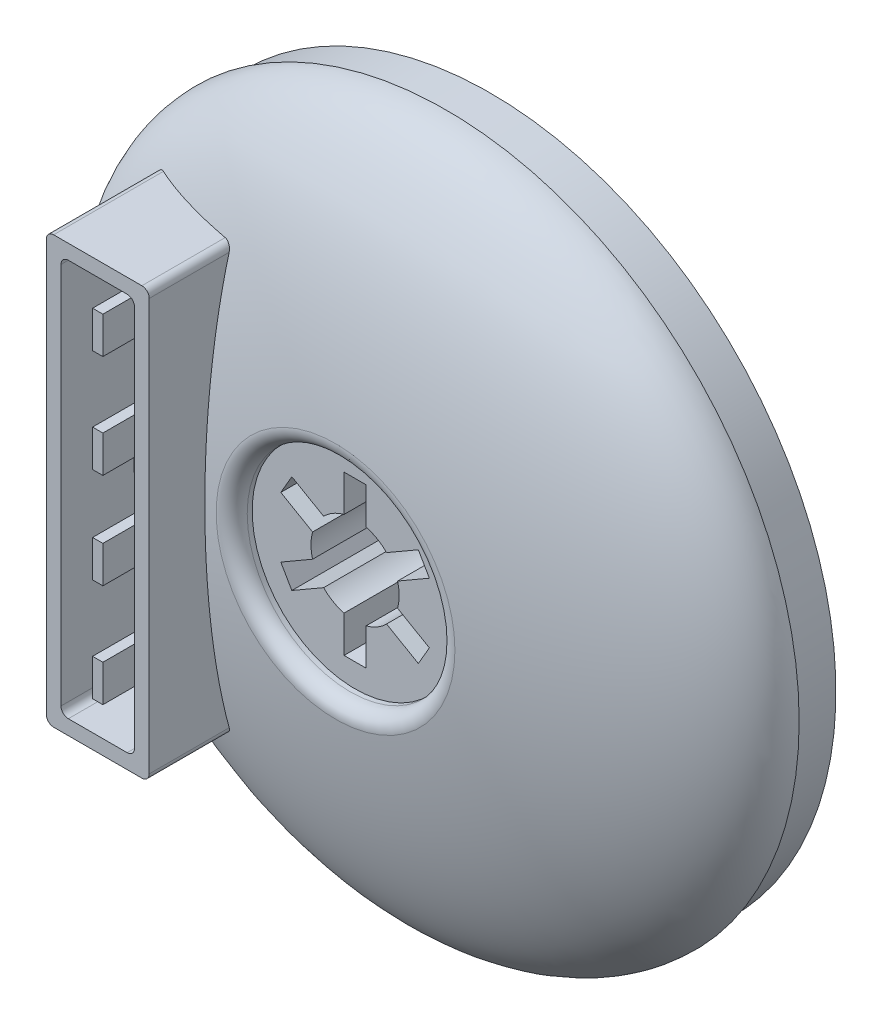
from build123d import *

# Parameters (mm, degrees)
SKETCH1_R                  = 24
EXTRUDE1_DEPTH             = 3
DOME1_FACE_RADIUS          = 24
DOME1_HEIGHT               = 8
SHELL1_T                   = -1
SKETCH2_OUTSIDE_W          = 63.754
SKETCH2_OUTSIDE_H          = 63.754
SKETCH2_OUTSIDE_R          = 23.5
EXTRUDE2_DEPTH             = 3
EXTRUDE4_REACH             = 37.679
SKETCH3_R                  = 7.5
EXTRUDE4_DIRECTION_2_DEPTH = 4
SKETCH4_R                  = 7
EXTRUDE5_DEPTH             = 5
FILLET1_R                  = 1
EXTRUDE6_DEPTH             = 37.922607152
SKETCH6_R                  = 5.5
EXTRUDE7_DEPTH             = 3
CHAMFER1_SIZE              = 2
EXTRUDE8_REACH             = 40.513
SKETCH7_W                  = 7
SKETCH7_H                  = 29
SKETCH7_W_2                = 5
SKETCH7_H_2                = 27
EXTRUDE9_REACH             = 40.513
SKETCH8_W                  = 0.7
SKETCH8_H                  = 2.5
FILLET2_R                  = 0.5


with BuildPart() as part:
    # Sketch1 → Extrude1 (new body)
    with BuildSketch(Plane.XY):
        Circle(SKETCH1_R)
    extrude(amount=EXTRUDE1_DEPTH)

    # Dome1: an elliptical dome of height H over a round flat face of radius A is half a spheroid: the quarter ellipse of half axes A and H revolved about the face's axis
    with BuildSketch(Plane((0, 0, 3), x_dir=(0, 1, 0), z_dir=(1, 0, 0)), mode=Mode.PRIVATE) as dome1_quarter:
        Ellipse(DOME1_FACE_RADIUS, DOME1_HEIGHT)
        Rectangle(DOME1_FACE_RADIUS, DOME1_HEIGHT, align=(Align.MIN, Align.MIN), mode=Mode.INTERSECT)
    revolve(dome1_quarter.sketch, axis=Axis((0, 0, 3), (0, 0, 1)))

    # Shell1
    shell1_openings = [part.faces().sort_by_distance(p)[0] for p in [
        (0, 0, 0),
    ]]
    offset(amount=SHELL1_T, openings=shell1_openings, kind=Kind.INTERSECTION)

    # Sketch2 outside → Extrude2 (cut)
    with BuildSketch(Plane(origin=(0, 0, 0), x_dir=(-1, 0, 0), z_dir=(0, 0, -1))):
        Rectangle(SKETCH2_OUTSIDE_W, SKETCH2_OUTSIDE_H)
        Circle(SKETCH2_OUTSIDE_R, mode=Mode.SUBTRACT)
    extrude(amount=-EXTRUDE2_DEPTH, mode=Mode.SUBTRACT)

    # Sketch3 → Extrude4 (add, up to next)
    with BuildSketch(Plane(origin=(0, 0, 0), x_dir=(-1, 0, 0), z_dir=(0, 0, -1)), mode=Mode.PRIVATE) as extrude4_sk1:
        with Locations(Location((0, 0, 0), (0, 0, 180))):
            Circle(SKETCH3_R)
    extrude4_tool1 = extrude(extrude4_sk1.sketch, amount=-EXTRUDE4_REACH, mode=Mode.PRIVATE) - part.part
    add(extrude4_tool1.solids().sort_by_distance((0, 0, 0))[0])

    # Sketch3 → Extrude4 direction 2 (add)
    with BuildSketch(Plane(origin=(0, 0, 0), x_dir=(-1, 0, 0), z_dir=(0, 0, -1))):
        with Locations(Location((0, 0, 0), (0, 0, 180))):
            Circle(SKETCH3_R)
    extrude(amount=EXTRUDE4_DIRECTION_2_DEPTH)

    # Sketch4 → Extrude5 (cut)
    with BuildSketch(Plane.XY.offset(14.2)):
        Circle(SKETCH4_R)
    extrude(amount=-EXTRUDE5_DEPTH, mode=Mode.SUBTRACT)

    # Fillet1
    fillet1_edges = [part.edges().sort_by_distance(p)[0] for p in [
        (-4.949747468, -4.949747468, 10.652160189),
    ]]
    fillet(fillet1_edges, radius=FILLET1_R)

    # Sketch5 → Extrude6 (cut, through all)
    with BuildSketch(Plane(origin=(0, 0, -4), x_dir=(-1, 0, 0), z_dir=(0, 0, -1))):
        with BuildLine():
            Line((2.890576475, -0.802849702), (5.05153718, -2.050480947))
            Line((5.05153718, -2.050480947), (4.30153718, -3.349519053))
            Line((4.30153718, -3.349519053), (2.140576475, -2.101887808))
            ThreePointArc((2.140576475, -2.101887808), (1.5, -2.598076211), (0.75, -2.90473751))
            Line((0.75, -2.90473751), (0.75, -5.4))
            Line((0.75, -5.4), (-0.75, -5.4))
            Line((-0.75, -5.4), (-0.75, -2.90473751))
            ThreePointArc((-0.75, -2.90473751), (-1.5, -2.598076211), (-2.140576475, -2.101887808))
            Line((-2.140576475, -2.101887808), (-4.30153718, -3.349519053))
            Line((-4.30153718, -3.349519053), (-5.05153718, -2.050480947))
            Line((-5.05153718, -2.050480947), (-2.890576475, -0.802849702))
            ThreePointArc((-2.890576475, -0.802849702), (-3, 0), (-2.890576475, 0.802849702))
            Line((-2.890576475, 0.802849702), (-5.05153718, 2.050480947))
            Line((-5.05153718, 2.050480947), (-4.30153718, 3.349519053))
            Line((-4.30153718, 3.349519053), (-2.140576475, 2.101887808))
            ThreePointArc((-2.140576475, 2.101887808), (-1.5, 2.598076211), (-0.75, 2.90473751))
            Line((-0.75, 2.90473751), (-0.75, 5.4))
            Line((-0.75, 5.4), (0.75, 5.4))
            Line((0.75, 5.4), (0.75, 2.90473751))
            ThreePointArc((0.75, 2.90473751), (1.5, 2.598076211), (2.140576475, 2.101887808))
            Line((2.140576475, 2.101887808), (4.30153718, 3.349519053))
            Line((4.30153718, 3.349519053), (5.05153718, 2.050480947))
            Line((5.05153718, 2.050480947), (2.890576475, 0.802849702))
            ThreePointArc((2.890576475, 0.802849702), (3, 0), (2.890576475, -0.802849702))
        make_face()
    extrude(amount=-EXTRUDE6_DEPTH, mode=Mode.SUBTRACT)

    # Sketch6 → Extrude7 (cut)
    with BuildSketch(Plane(origin=(0, 0, -4), x_dir=(-1, 0, 0), z_dir=(0, 0, -1))):
        Circle(SKETCH6_R)
    extrude(amount=-EXTRUDE7_DEPTH, mode=Mode.SUBTRACT)

    # Chamfer1
    chamfer1_edges = [part.edges().sort_by_distance(p)[0] for p in [
        (-1.5, 2.598076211, -1),
        (-3, 0, -1),
        (-1.5, -2.598076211, -1),
        (1.5, -2.598076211, -1),
        (3, 0, -1),
        (1.5, 2.598076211, -1),
    ]]
    chamfer(chamfer1_edges, length=CHAMFER1_SIZE)

    # Sketch7 → Extrude8 (add, up to next)
    with BuildSketch(Plane.XY.offset(14.2), mode=Mode.PRIVATE) as extrude8_sk1:
        with Locations((-12.5, 0)):
            Rectangle(SKETCH7_W, SKETCH7_H)
        with Locations((-12.5, 0)):
            Rectangle(SKETCH7_W_2, SKETCH7_H_2, mode=Mode.SUBTRACT)
    extrude8_tool1 = extrude(extrude8_sk1.sketch, amount=-EXTRUDE8_REACH, mode=Mode.PRIVATE) - part.part
    add(extrude8_tool1.solids().sort_by_distance((-15.701671, 0, 14.2))[0])

    # Sketch8 → Extrude9 (add, up to next)
    with BuildSketch(Plane.XY.offset(14.2), mode=Mode.PRIVATE) as extrude9_sk1:
        with Locations((-12.5, 10.25)):
            Rectangle(SKETCH8_W, SKETCH8_H)
    extrude9_tool1 = extrude(extrude9_sk1.sketch, amount=-EXTRUDE9_REACH, mode=Mode.PRIVATE) - part.part
    # Sketch8 → Extrude9 (add, up to next)
    with BuildSketch(Plane.XY.offset(14.2), mode=Mode.PRIVATE) as extrude9_sk2:
        with Locations((-12.5, -10.25)):
            Rectangle(SKETCH8_W, SKETCH8_H)
    extrude9_tool2 = extrude(extrude9_sk2.sketch, amount=-EXTRUDE9_REACH, mode=Mode.PRIVATE) - part.part
    # Sketch8 → Extrude9 (add, up to next)
    with BuildSketch(Plane.XY.offset(14.2), mode=Mode.PRIVATE) as extrude9_sk3:
        with Locations((-12.5, 3.25)):
            Rectangle(SKETCH8_W, SKETCH8_H)
    extrude9_tool3 = extrude(extrude9_sk3.sketch, amount=-EXTRUDE9_REACH, mode=Mode.PRIVATE) - part.part
    # Sketch8 → Extrude9 (add, up to next)
    with BuildSketch(Plane.XY.offset(14.2), mode=Mode.PRIVATE) as extrude9_sk4:
        with Locations((-12.5, -3.25)):
            Rectangle(SKETCH8_W, SKETCH8_H)
    extrude9_tool4 = extrude(extrude9_sk4.sketch, amount=-EXTRUDE9_REACH, mode=Mode.PRIVATE) - part.part
    add(extrude9_tool1.solids().sort_by_distance((-12.5, 10.25, 14.2))[0])
    add(extrude9_tool2.solids().sort_by_distance((-12.5, -10.25, 14.2))[0])
    add(extrude9_tool3.solids().sort_by_distance((-12.5, 3.25, 14.2))[0])
    add(extrude9_tool4.solids().sort_by_distance((-12.5, -3.25, 14.2))[0])

    # Fillet2
    fillet2_edges = [part.edges().sort_by_distance(p)[0] for p in [
        (-15, 13.5, 10.765063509),
        (-10, -13.5, 11.45652275),
        (-15, -13.5, 10.765063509),
        (-10, 13.5, 11.45652275),
        (-16, 14.5, 10.346027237),
        (-16, -14.5, 10.346027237),
        (-9, -14.5, 11.412422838),
        (-9, 14.5, 11.412422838),
    ]]
    fillet(fillet2_edges, radius=FILLET2_R)


solid = part.part
